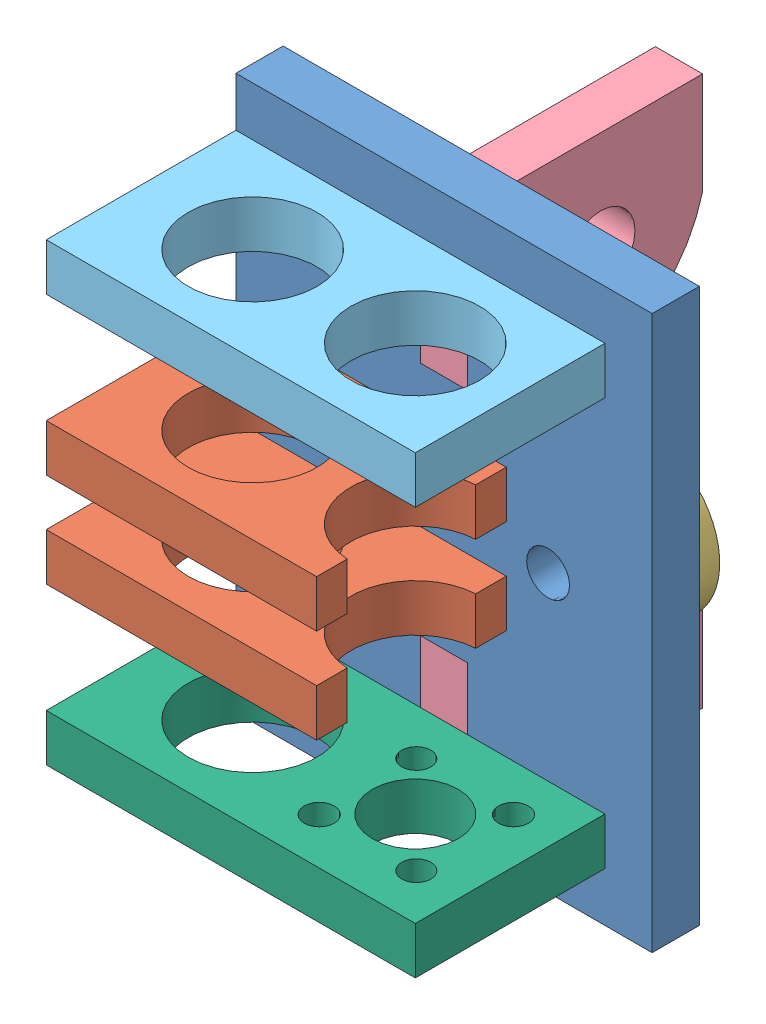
SolidWorks assembly holder3.SLDASM, configuration Default (file format 11000). Lengths in mm.
Overall size (48.5 64.5 49.48).
7 component instances, 6 part files, 17 mates.
Components (placement in the parent):
- nut_holder2-1: nut_holder2.SLDPRT [Default] at (-3.8468 38.358 61.0518) size (48.5 64.5 5.5)
- bearing_holder1-1: bearing_holder1.SLDPRT [Default] at (15.8837 29.7067 75.1069) x (-1 0 0) z (0 0 -1) size (31.5 5.5 27.6)
- idler_holder-1: idler_holder.SLDPRT [Default] at (30.3486 37.9567 55.5518) size (18 18 5.5)
- rod_holder-1: rod_holder.SLDPRT [Default] at (15.4736 11.4567 66.5518) x (1 0 0) z (0 1 0) size (5.5 27.38 64)
- bearing_holder2-1: bearing_holder2.SLDPRT [Default] at (-0.4077 58.9567 61.0518) x (-1 0 0) z (0 1 0) size (43 27.6 5.5)
- screw_holder-1: screw_holder.SLDPRT [Default] at (-0.4077 11.4567 61.0518) x (-1 0 0) z (0 0 -1) size (43 5.5 27.6)
- bearing_holder1-2: bearing_holder1.SLDPRT [Default] at (15.8837 40.7067 75.1069) x (-1 0 0) z (0 0 -1) size (31.5 5.5 27.6)
Mates (geometry in assembly coordinates):
- Coincident9: coincident: plane of nut_holder2-1 through (-3.8468 38.358 61.0518) normal (0 0 -1); plane of bearing_holder1-2 through (8.1402 46.2067 61.0518) normal (0 0 -1)
- Coincident10: coincident: plane of nut_holder2-1 through (-3.8468 38.358 61.0518) normal (0 0 -1); plane of bearing_holder1-1 through (8.1402 35.2067 61.0518) normal (0 0 -1)
- Coincident11: coincident: plane of nut_holder2-1 through (8.1402 40.7067 66.5518) normal (0 1 0); plane of bearing_holder1-2 through (25.9236 40.7067 77.6018) normal (0 -1 0)
- Coincident12: coincident: plane of nut_holder2-1 through (-0.5264 35.2067 66.5518) normal (0 -1 0); plane of bearing_holder1-1 through (25.9236 35.2067 77.6018) normal (0 1 0)
- Coincident14: coincident: plane of nut_holder2-1 through (8.1402 35.2067 66.5518) normal (-1 0 0); plane of bearing_holder1-1 through (8.1402 35.2067 66.5518) normal (1 0 0)
- Coincident15: coincident: plane of nut_holder2-1 through (16.8069 40.7067 66.5518) normal (1 0 0); plane of bearing_holder1-2 through (16.8069 46.2067 61.0518) normal (-1 0 0)
- Coincident16: coincident: plane of nut_holder2-1 through (-3.8468 38.358 66.5518) normal (0 0 1); plane of rod_holder-1 through (20.9736 11.4567 66.5518) normal (0 0 1)
- Coincident17: coincident: plane of nut_holder2-1 through (20.9736 24.2067 66.5518) normal (-1 0 0); plane of rod_holder-1 through (20.9736 11.4567 66.5518) normal (1 0 0)
- Coincident18: coincident: plane of nut_holder2-1 through (20.9736 64.4567 66.5518) normal (0 -1 0); plane of rod_holder-1 through (20.9736 64.4567 66.5518) normal (0 1 0)
- Coincident19: coincident: plane of nut_holder2-1 through (-3.8468 38.358 61.0518) normal (0 0 -1); plane of idler_holder-1 through (30.3486 37.9567 61.0518) normal (0 0 1)
- Concentric1: concentric: cylinder of nut_holder2-1 through (30.3486 37.9567 66.5518) axis (0 0 -1) radius 2.5; cylinder of idler_holder-1 through (30.3486 37.9567 61.0518) axis (0 0 -1) radius 2.5
- Coincident23: coincident: plane of nut_holder2-1 through (-3.8468 38.358 61.0518) normal (0 0 -1); plane of screw_holder-1 through (9.9736 16.9567 61.0518) normal (0 0 -1)
- Coincident24: coincident: plane of nut_holder2-1 through (9.9736 11.4567 66.5518) normal (0 1 0); plane of screw_holder-1 through (-0.4077 11.4567 61.0518) normal (0 -1 0)
- Coincident25: coincident: plane of nut_holder2-1 through (36.9736 16.9567 66.5518) normal (-1 0 0); plane of screw_holder-1 through (36.9736 16.9567 88.6518) normal (1 0 0)
- Coincident26: coincident: plane of nut_holder2-1 through (-3.8468 38.358 61.0518) normal (0 0 -1); plane of bearing_holder2-1 through (36.9736 64.4567 61.0518) normal (0 0 -1)
- Coincident27: coincident: plane of nut_holder2-1 through (9.9736 58.9567 66.5518) normal (0 1 0); plane of bearing_holder2-1 through (-0.4077 58.9567 61.0518) normal (0 -1 0)
- Coincident28: coincident: plane of nut_holder2-1 through (9.9736 64.4567 66.5518) normal (-1 0 0); line of bearing_holder2-1 through (9.9736 64.4567 61.0518) axis (0 -1 0)
